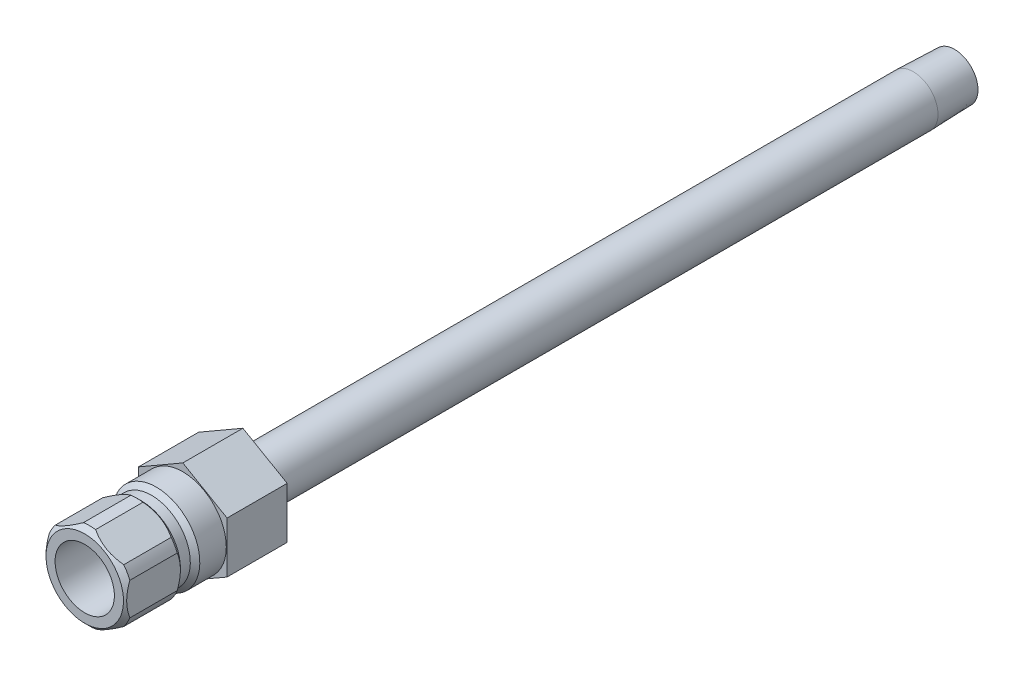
ISO-10303-21;
HEADER;
FILE_DESCRIPTION(('STEP AP214'),'2;1');
FILE_NAME('part.step','',(''),(''),'','','');
FILE_SCHEMA(('AUTOMOTIVE_DESIGN { 1 0 10303 214 1 1 1 1 }'));
ENDSEC;
DATA;
#1=APPLICATION_CONTEXT('core data for automotive mechanical design processes');
#2=APPLICATION_PROTOCOL_DEFINITION('international standard','automotive_design',2000,#1);
#3=PRODUCT_CONTEXT('',#1,'mechanical');
#4=PRODUCT('Part','Part','',(#3));
#5=PRODUCT_RELATED_PRODUCT_CATEGORY('part','',(#4));
#6=PRODUCT_DEFINITION_FORMATION('','',#4);
#7=PRODUCT_DEFINITION_CONTEXT('part definition',#1,'design');
#8=PRODUCT_DEFINITION('design','',#6,#7);
#9=PRODUCT_DEFINITION_SHAPE('','',#8);
#10=(LENGTH_UNIT() NAMED_UNIT(*) SI_UNIT(.MILLI.,.METRE.));
#11=(NAMED_UNIT(*) PLANE_ANGLE_UNIT() SI_UNIT($,.RADIAN.));
#12=(NAMED_UNIT(*) SI_UNIT($,.STERADIAN.) SOLID_ANGLE_UNIT());
#13=UNCERTAINTY_MEASURE_WITH_UNIT(LENGTH_MEASURE(1.E-05),#10,'distance_accuracy_value','');
#14=(GEOMETRIC_REPRESENTATION_CONTEXT(3) GLOBAL_UNCERTAINTY_ASSIGNED_CONTEXT((#13)) GLOBAL_UNIT_ASSIGNED_CONTEXT((#10,
#11,#12)) REPRESENTATION_CONTEXT('',''));
#15=CARTESIAN_POINT('',(0.,0.,0.));
#16=DIRECTION('',(0.,0.,1.));
#17=DIRECTION('',(1.,0.,0.));
#18=AXIS2_PLACEMENT_3D('',#15,#16,#17);
#19=CARTESIAN_POINT('',(0.,0.,-9.652));
#20=DIRECTION('',(0.,0.,-1.));
#21=DIRECTION('',(0.,1.,0.));
#22=AXIS2_PLACEMENT_3D('',#19,#20,#21);
#23=CYLINDRICAL_SURFACE('',#22,6.985);
#24=DIRECTION('',(0.,0.,-1.));
#25=VECTOR('',#24,1.);
#26=CARTESIAN_POINT('',(6.477,2.61509005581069,-9.652));
#27=LINE('',#26,#25);
#28=CARTESIAN_POINT('',(6.477,2.61509005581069,7.366));
#29=VERTEX_POINT('',#28);
#30=CARTESIAN_POINT('',(6.477,2.61509005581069,14.986));
#31=VERTEX_POINT('',#30);
#32=EDGE_CURVE('E381',#29,#31,#27,.F.);
#33=ORIENTED_EDGE('',*,*,#32,.F.);
#34=CARTESIAN_POINT('',(0.,0.,7.366));
#35=DIRECTION('',(0.,0.,-1.));
#36=DIRECTION('',(0.,1.,0.));
#37=AXIS2_PLACEMENT_3D('',#34,#35,#36);
#38=CIRCLE('',#37,6.985);
#39=CARTESIAN_POINT('',(5.50323442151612,4.30170151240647,7.366));
#40=VERTEX_POINT('',#39);
#41=EDGE_CURVE('E190',#40,#29,#38,.T.);
#42=ORIENTED_EDGE('',*,*,#41,.F.);
#43=DIRECTION('',(0.,0.,-1.));
#44=VECTOR('',#43,1.);
#45=CARTESIAN_POINT('',(5.50323442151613,4.30170151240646,-9.652));
#46=LINE('',#45,#44);
#47=CARTESIAN_POINT('',(5.50323442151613,4.30170151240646,14.986));
#48=VERTEX_POINT('',#47);
#49=EDGE_CURVE('E372',#48,#40,#46,.T.);
#50=ORIENTED_EDGE('',*,*,#49,.F.);
#51=CARTESIAN_POINT('',(0.,0.,14.986));
#52=DIRECTION('',(0.,0.,-1.));
#53=DIRECTION('',(0.,1.,0.));
#54=AXIS2_PLACEMENT_3D('',#51,#52,#53);
#55=CIRCLE('',#54,6.985);
#56=EDGE_CURVE('E205',#48,#31,#55,.T.);
#57=ORIENTED_EDGE('',*,*,#56,.T.);
#58=EDGE_LOOP('',(#33,#42,#50,#57));
#59=FACE_BOUND('',#58,.T.);
#60=ADVANCED_FACE('F34',(#59),#23,.T.);
#61=DIRECTION('',(0.,0.,-1.));
#62=VECTOR('',#61,1.);
#63=CARTESIAN_POINT('',(0.973765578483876,6.91679156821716,-9.652));
#64=LINE('',#63,#62);
#65=CARTESIAN_POINT('',(0.973765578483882,6.91679156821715,7.366));
#66=VERTEX_POINT('',#65);
#67=CARTESIAN_POINT('',(0.973765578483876,6.91679156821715,14.986));
#68=VERTEX_POINT('',#67);
#69=EDGE_CURVE('E291',#66,#68,#64,.F.);
#70=ORIENTED_EDGE('',*,*,#69,.F.);
#71=CARTESIAN_POINT('',(-0.973765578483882,6.91679156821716,7.366));
#72=VERTEX_POINT('',#71);
#73=EDGE_CURVE('E194',#72,#66,#38,.T.);
#74=ORIENTED_EDGE('',*,*,#73,.F.);
#75=DIRECTION('',(0.,0.,-1.));
#76=VECTOR('',#75,1.);
#77=CARTESIAN_POINT('',(-0.973765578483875,6.91679156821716,-9.652));
#78=LINE('',#77,#76);
#79=CARTESIAN_POINT('',(-0.973765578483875,6.91679156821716,14.986));
#80=VERTEX_POINT('',#79);
#81=EDGE_CURVE('E54',#80,#72,#78,.T.);
#82=ORIENTED_EDGE('',*,*,#81,.F.);
#83=EDGE_CURVE('E193',#80,#68,#55,.T.);
#84=ORIENTED_EDGE('',*,*,#83,.T.);
#85=EDGE_LOOP('',(#70,#74,#82,#84));
#86=FACE_BOUND('',#85,.T.);
#87=ADVANCED_FACE('F325',(#86),#23,.T.);
#88=DIRECTION('',(0.,0.,-1.));
#89=VECTOR('',#88,1.);
#90=CARTESIAN_POINT('',(-5.50323442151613,4.30170151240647,-9.652));
#91=LINE('',#90,#89);
#92=CARTESIAN_POINT('',(-5.50323442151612,4.30170151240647,7.366));
#93=VERTEX_POINT('',#92);
#94=CARTESIAN_POINT('',(-5.50323442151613,4.30170151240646,14.986));
#95=VERTEX_POINT('',#94);
#96=EDGE_CURVE('E370',#93,#95,#91,.F.);
#97=ORIENTED_EDGE('',*,*,#96,.F.);
#98=CARTESIAN_POINT('',(-6.477,2.6150900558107,7.366));
#99=VERTEX_POINT('',#98);
#100=EDGE_CURVE('E199',#99,#93,#38,.T.);
#101=ORIENTED_EDGE('',*,*,#100,.F.);
#102=DIRECTION('',(0.,0.,-1.));
#103=VECTOR('',#102,1.);
#104=CARTESIAN_POINT('',(-6.477,2.6150900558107,-9.652));
#105=LINE('',#104,#103);
#106=CARTESIAN_POINT('',(-6.477,2.61509005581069,14.986));
#107=VERTEX_POINT('',#106);
#108=EDGE_CURVE('E62',#107,#99,#105,.T.);
#109=ORIENTED_EDGE('',*,*,#108,.F.);
#110=EDGE_CURVE('E204',#107,#95,#55,.T.);
#111=ORIENTED_EDGE('',*,*,#110,.T.);
#112=EDGE_LOOP('',(#97,#101,#109,#111));
#113=FACE_BOUND('',#112,.T.);
#114=ADVANCED_FACE('F330',(#113),#23,.T.);
#115=DIRECTION('',(0.,0.,-1.));
#116=VECTOR('',#115,1.);
#117=CARTESIAN_POINT('',(-6.477,-2.6150900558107,-9.652));
#118=LINE('',#117,#116);
#119=CARTESIAN_POINT('',(-6.477,-2.6150900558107,7.366));
#120=VERTEX_POINT('',#119);
#121=CARTESIAN_POINT('',(-6.477,-2.6150900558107,14.986));
#122=VERTEX_POINT('',#121);
#123=EDGE_CURVE('E362',#120,#122,#118,.F.);
#124=ORIENTED_EDGE('',*,*,#123,.F.);
#125=CARTESIAN_POINT('',(-5.50323442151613,-4.30170151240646,7.366));
#126=VERTEX_POINT('',#125);
#127=EDGE_CURVE('E195',#126,#120,#38,.T.);
#128=ORIENTED_EDGE('',*,*,#127,.F.);
#129=DIRECTION('',(0.,0.,-1.));
#130=VECTOR('',#129,1.);
#131=CARTESIAN_POINT('',(-5.50323442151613,-4.30170151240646,-9.652));
#132=LINE('',#131,#130);
#133=CARTESIAN_POINT('',(-5.50323442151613,-4.30170151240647,14.986));
#134=VERTEX_POINT('',#133);
#135=EDGE_CURVE('E245',#134,#126,#132,.T.);
#136=ORIENTED_EDGE('',*,*,#135,.F.);
#137=EDGE_CURVE('E376',#134,#122,#55,.T.);
#138=ORIENTED_EDGE('',*,*,#137,.T.);
#139=EDGE_LOOP('',(#124,#128,#136,#138));
#140=FACE_BOUND('',#139,.T.);
#141=ADVANCED_FACE('F340',(#140),#23,.T.);
#142=DIRECTION('',(0.,0.,-1.));
#143=VECTOR('',#142,1.);
#144=CARTESIAN_POINT('',(-0.97376557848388,-6.91679156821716,-9.652));
#145=LINE('',#144,#143);
#146=CARTESIAN_POINT('',(-0.973765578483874,-6.91679156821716,7.366));
#147=VERTEX_POINT('',#146);
#148=CARTESIAN_POINT('',(-0.97376557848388,-6.91679156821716,14.986));
#149=VERTEX_POINT('',#148);
#150=EDGE_CURVE('E351',#147,#149,#145,.F.);
#151=ORIENTED_EDGE('',*,*,#150,.F.);
#152=CARTESIAN_POINT('',(0.973765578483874,-6.91679156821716,7.366));
#153=VERTEX_POINT('',#152);
#154=EDGE_CURVE('E191',#153,#147,#38,.T.);
#155=ORIENTED_EDGE('',*,*,#154,.F.);
#156=DIRECTION('',(0.,0.,-1.));
#157=VECTOR('',#156,1.);
#158=CARTESIAN_POINT('',(0.973765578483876,-6.91679156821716,-9.652));
#159=LINE('',#158,#157);
#160=CARTESIAN_POINT('',(0.973765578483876,-6.91679156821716,14.986));
#161=VERTEX_POINT('',#160);
#162=EDGE_CURVE('E168',#161,#153,#159,.T.);
#163=ORIENTED_EDGE('',*,*,#162,.F.);
#164=EDGE_CURVE('E353',#161,#149,#55,.T.);
#165=ORIENTED_EDGE('',*,*,#164,.T.);
#166=EDGE_LOOP('',(#151,#155,#163,#165));
#167=FACE_BOUND('',#166,.T.);
#168=ADVANCED_FACE('F334',(#167),#23,.T.);
#169=CARTESIAN_POINT('',(0.,0.,-9.652));
#170=DIRECTION('',(0.,0.,-1.));
#171=DIRECTION('',(0.,1.,0.));
#172=AXIS2_PLACEMENT_3D('',#169,#170,#171);
#173=CYLINDRICAL_SURFACE('',#172,2.65430000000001);
#174=CARTESIAN_POINT('',(0.,0.,2.43505017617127));
#175=DIRECTION('',(0.,0.,-1.));
#176=DIRECTION('',(0.,1.,0.));
#177=AXIS2_PLACEMENT_3D('',#174,#175,#176);
#178=CIRCLE('',#177,2.6543);
#179=CARTESIAN_POINT('',(0.,2.6543,2.43505017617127));
#180=VERTEX_POINT('',#179);
#181=EDGE_CURVE('E215',#180,#180,#178,.T.);
#182=ORIENTED_EDGE('',*,*,#181,.F.);
#183=EDGE_LOOP('',(#182));
#184=FACE_BOUND('',#183,.T.);
#185=CARTESIAN_POINT('',(0.,0.,-123.952));
#186=DIRECTION('',(0.,0.,-1.));
#187=DIRECTION('',(0.,1.,0.));
#188=AXIS2_PLACEMENT_3D('',#185,#186,#187);
#189=CIRCLE('',#188,2.65430000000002);
#190=CARTESIAN_POINT('',(0.,2.65430000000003,-123.952));
#191=VERTEX_POINT('',#190);
#192=EDGE_CURVE('E429',#191,#191,#189,.T.);
#193=ORIENTED_EDGE('',*,*,#192,.T.);
#194=EDGE_LOOP('',(#193));
#195=FACE_BOUND('',#194,.T.);
#196=ADVANCED_FACE('F36',(#184,#195),#173,.F.);
#197=CARTESIAN_POINT('',(0.,0.,3.556));
#198=DIRECTION('',(0.,0.,1.));
#199=DIRECTION('',(0.,-1.,0.));
#200=AXIS2_PLACEMENT_3D('',#197,#198,#199);
#201=CONICAL_SURFACE('',#200,4.7625,1.08210413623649);
#202=ORIENTED_EDGE('',*,*,#181,.T.);
#203=EDGE_LOOP('',(#202));
#204=FACE_BOUND('',#203,.T.);
#205=CARTESIAN_POINT('',(0.,0.,3.556));
#206=DIRECTION('',(0.,0.,-1.));
#207=DIRECTION('',(0.,1.,0.));
#208=AXIS2_PLACEMENT_3D('',#205,#206,#207);
#209=CIRCLE('',#208,4.7625);
#210=CARTESIAN_POINT('',(0.,4.7625,3.556));
#211=VERTEX_POINT('',#210);
#212=EDGE_CURVE('E212',#211,#211,#209,.T.);
#213=ORIENTED_EDGE('',*,*,#212,.F.);
#214=EDGE_LOOP('',(#213));
#215=FACE_BOUND('',#214,.T.);
#216=ADVANCED_FACE('F346',(#204,#215),#201,.F.);
#217=CARTESIAN_POINT('',(0.,0.,-9.652));
#218=DIRECTION('',(0.,0.,-1.));
#219=DIRECTION('',(0.,1.,0.));
#220=AXIS2_PLACEMENT_3D('',#217,#218,#219);
#221=CYLINDRICAL_SURFACE('',#220,4.7625);
#222=ORIENTED_EDGE('',*,*,#212,.T.);
#223=EDGE_LOOP('',(#222));
#224=FACE_BOUND('',#223,.T.);
#225=CARTESIAN_POINT('',(0.,0.,15.748));
#226=DIRECTION('',(0.,0.,-1.));
#227=DIRECTION('',(0.,1.,0.));
#228=AXIS2_PLACEMENT_3D('',#225,#226,#227);
#229=CIRCLE('',#228,4.7625);
#230=CARTESIAN_POINT('',(0.,4.7625,15.748));
#231=VERTEX_POINT('',#230);
#232=EDGE_CURVE('E209',#231,#231,#229,.T.);
#233=ORIENTED_EDGE('',*,*,#232,.F.);
#234=EDGE_LOOP('',(#233));
#235=FACE_BOUND('',#234,.T.);
#236=ADVANCED_FACE('F671',(#224,#235),#221,.F.);
#237=CARTESIAN_POINT('',(0.,4.7625,15.748));
#238=DIRECTION('',(0.,0.,1.));
#239=DIRECTION('',(0.,-1.,0.));
#240=AXIS2_PLACEMENT_3D('',#237,#238,#239);
#241=PLANE('',#240);
#242=ORIENTED_EDGE('',*,*,#232,.T.);
#243=EDGE_LOOP('',(#242));
#244=FACE_BOUND('',#243,.T.);
#245=CARTESIAN_POINT('',(0.,0.,15.748));
#246=DIRECTION('',(0.,0.,-1.));
#247=DIRECTION('',(0.,1.,0.));
#248=AXIS2_PLACEMENT_3D('',#245,#246,#247);
#249=CIRCLE('',#248,6.223);
#250=CARTESIAN_POINT('',(0.,6.223,15.748));
#251=VERTEX_POINT('',#250);
#252=EDGE_CURVE('E206',#251,#251,#249,.T.);
#253=ORIENTED_EDGE('',*,*,#252,.F.);
#254=EDGE_LOOP('',(#253));
#255=FACE_BOUND('',#254,.T.);
#256=ADVANCED_FACE('F252',(#244,#255),#241,.T.);
#257=CARTESIAN_POINT('',(0.,0.,14.986));
#258=DIRECTION('',(0.,0.,-1.));
#259=DIRECTION('',(0.,1.,0.));
#260=AXIS2_PLACEMENT_3D('',#257,#258,#259);
#261=CONICAL_SURFACE('',#260,6.985,0.785398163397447);
#262=CARTESIAN_POINT('',(6.477,-7.50531717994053,12.0573066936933));
#263=CARTESIAN_POINT('',(6.477,-7.32278230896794,12.1954662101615));
#264=CARTESIAN_POINT('',(6.477,-7.13923073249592,12.3323042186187));
#265=CARTESIAN_POINT('',(6.477,-6.76969107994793,12.6027438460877));
#266=CARTESIAN_POINT('',(6.477,-6.58370240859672,12.7363446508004));
#267=CARTESIAN_POINT('',(6.477,-6.20752484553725,13.0006667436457));
#268=CARTESIAN_POINT('',(6.477,-6.01731457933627,13.1313577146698));
#269=CARTESIAN_POINT('',(6.477,-5.63367369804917,13.3879087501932));
#270=CARTESIAN_POINT('',(6.477,-5.44024331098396,13.5137691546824));
#271=CARTESIAN_POINT('',(6.477,-5.03831720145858,13.7667102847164));
#272=CARTESIAN_POINT('',(6.477,-4.8295984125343,13.8934383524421));
#273=CARTESIAN_POINT('',(6.477,-4.40728395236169,14.1386241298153));
#274=CARTESIAN_POINT('',(6.477,-4.19368750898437,14.2570805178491));
#275=CARTESIAN_POINT('',(6.477,-3.7616267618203,14.4831715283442));
#276=CARTESIAN_POINT('',(6.477,-3.54317924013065,14.5908379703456));
#277=CARTESIAN_POINT('',(6.477,-3.100295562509,14.7929384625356));
#278=CARTESIAN_POINT('',(6.477,-2.87586219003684,14.8873785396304));
#279=CARTESIAN_POINT('',(6.477,-2.43955826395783,15.0524966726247));
#280=CARTESIAN_POINT('',(6.477,-2.22819339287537,15.1244971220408));
#281=CARTESIAN_POINT('',(6.477,-1.80033354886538,15.2515475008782));
#282=CARTESIAN_POINT('',(6.477,-1.58383822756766,15.3065962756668));
#283=CARTESIAN_POINT('',(6.477,-1.1506339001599,15.3959385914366));
#284=CARTESIAN_POINT('',(6.477,-0.934000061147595,15.4305906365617));
#285=CARTESIAN_POINT('',(6.477,-0.498364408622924,15.4784594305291));
#286=CARTESIAN_POINT('',(6.477,-0.279363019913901,15.4916799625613));
#287=CARTESIAN_POINT('',(6.477,0.150697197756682,15.4956835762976));
#288=CARTESIAN_POINT('',(6.477,0.361748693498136,15.4872823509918));
#289=CARTESIAN_POINT('',(6.477,0.782066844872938,15.4503172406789));
#290=CARTESIAN_POINT('',(6.477,0.991333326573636,15.421751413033));
#291=CARTESIAN_POINT('',(6.477,1.41010575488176,15.3455375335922));
#292=CARTESIAN_POINT('',(6.477,1.6195513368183,15.2975631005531));
#293=CARTESIAN_POINT('',(6.477,2.03387291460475,15.1851046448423));
#294=CARTESIAN_POINT('',(6.477,2.2387492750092,15.1206219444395));
#295=CARTESIAN_POINT('',(6.477,2.66141718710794,14.9715598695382));
#296=CARTESIAN_POINT('',(6.477,2.87875617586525,14.8857103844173));
#297=CARTESIAN_POINT('',(6.477,3.30779766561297,14.7008180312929));
#298=CARTESIAN_POINT('',(6.477,3.51949749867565,14.6017690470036));
#299=CARTESIAN_POINT('',(6.477,3.9382898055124,14.3928329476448));
#300=CARTESIAN_POINT('',(6.477,4.14536521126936,14.282911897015));
#301=CARTESIAN_POINT('',(6.477,4.55475391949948,14.0546596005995));
#302=CARTESIAN_POINT('',(6.477,4.75706796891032,13.93632968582));
#303=CARTESIAN_POINT('',(6.477,5.14761370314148,13.6989609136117));
#304=CARTESIAN_POINT('',(6.477,5.33604552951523,13.580249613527));
#305=CARTESIAN_POINT('',(6.477,5.70967381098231,13.3378251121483));
#306=CARTESIAN_POINT('',(6.477,5.89487001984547,13.2141115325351));
#307=CARTESIAN_POINT('',(6.477,6.26095063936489,12.9635958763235));
#308=CARTESIAN_POINT('',(6.477,6.44185783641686,12.8368269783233));
#309=CARTESIAN_POINT('',(6.477,6.80119835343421,12.5799293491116));
#310=CARTESIAN_POINT('',(6.477,6.97963234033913,12.4498015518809));
#311=CARTESIAN_POINT('',(6.477,7.15703038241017,12.3183002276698));
#312=B_SPLINE_CURVE_WITH_KNOTS('',3,(#262,#263,#264,#265,#266,#267,#268,#269,#270,#271,#272,
#273,#274,#275,#276,#277,#278,#279,#280,#281,#282,#283,#284,#285,#286,#287,#288,#289,#290,#291,
#292,#293,#294,#295,#296,#297,#298,#299,#300,#301,#302,#303,#304,#305,#306,#307,#308,#309,#310,
#311),.UNSPECIFIED.,.F.,.F.,(4,2,2,2,2,2,2,2,2,2,2,2,2,2,2,2,2,2,2,2,2,2,2,2,4),(0.,
0.686790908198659,1.37375281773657,2.06603541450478,2.75826919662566,3.49065471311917,
4.22315698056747,4.95343127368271,5.68337170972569,6.35265989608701,7.02199365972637,
7.67918147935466,8.33625327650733,8.96890298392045,9.6016136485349,10.2454384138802,
10.8892116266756,11.5897073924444,12.2905288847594,12.9936114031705,13.6965828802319,
14.3646145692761,15.0326968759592,15.6953618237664,16.3578444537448),.UNSPECIFIED.);
#313=CARTESIAN_POINT('',(6.477,-2.61509005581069,14.986));
#314=VERTEX_POINT('',#313);
#315=EDGE_CURVE('E384',#31,#314,#312,.F.);
#316=ORIENTED_EDGE('',*,*,#315,.F.);
#317=ORIENTED_EDGE('',*,*,#56,.F.);
#318=CARTESIAN_POINT('',(0.973302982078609,6.91705864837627,14.9858));
#319=CARTESIAN_POINT('',(1.15430521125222,6.81255696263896,15.0641166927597));
#320=CARTESIAN_POINT('',(1.33782092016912,6.70660411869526,15.1353544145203));
#321=CARTESIAN_POINT('',(1.70963160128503,6.49193912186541,15.2608524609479));
#322=CARTESIAN_POINT('',(1.89793754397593,6.38322063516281,15.3150691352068));
#323=CARTESIAN_POINT('',(2.27146153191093,6.16756646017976,15.401724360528));
#324=CARTESIAN_POINT('',(2.45655498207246,6.06070270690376,15.4348622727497));
#325=CARTESIAN_POINT('',(2.82844640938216,5.8459910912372,15.4802195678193));
#326=CARTESIAN_POINT('',(3.01524193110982,5.73814464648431,15.4924653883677));
#327=CARTESIAN_POINT('',(3.39480578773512,5.51900335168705,15.4953056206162));
#328=CARTESIAN_POINT('',(3.58757842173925,5.40770601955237,15.4852117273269));
#329=CARTESIAN_POINT('',(3.97148128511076,5.18605959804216,15.4426708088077));
#330=CARTESIAN_POINT('',(4.16260891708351,5.07571200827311,15.4101933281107));
#331=CARTESIAN_POINT('',(4.54854122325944,4.85289388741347,15.3234273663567));
#332=CARTESIAN_POINT('',(4.74321398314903,4.74049951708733,15.268364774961));
#333=CARTESIAN_POINT('',(5.03141021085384,4.57410934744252,15.1720079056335));
#334=CARTESIAN_POINT('',(5.12673323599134,4.51907457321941,15.1376422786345));
#335=CARTESIAN_POINT('',(5.31613879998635,4.40972121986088,15.0647445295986));
#336=CARTESIAN_POINT('',(5.41022179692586,4.35540237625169,15.0262139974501));
#337=CARTESIAN_POINT('',(5.5036970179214,4.30143443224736,14.9858));
#338=B_SPLINE_CURVE_WITH_KNOTS('',3,(#318,#319,#320,#321,#322,#323,#324,#325,#326,#327,#328,
#329,#330,#331,#332,#333,#334,#335,#336,#337),.UNSPECIFIED.,.F.,.F.,(4,2,2,2,2,2,2,2,2,4),(0.,
0.669810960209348,1.34132587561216,1.9892054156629,2.63626449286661,3.30353665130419,
3.97171850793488,4.6650216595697,5.01088265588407,5.3566120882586),.UNSPECIFIED.);
#339=EDGE_CURVE('E283',#68,#48,#338,.T.);
#340=ORIENTED_EDGE('',*,*,#339,.F.);
#341=ORIENTED_EDGE('',*,*,#83,.F.);
#342=CARTESIAN_POINT('',(-5.50369701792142,4.30143443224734,14.9858));
#343=CARTESIAN_POINT('',(-5.32269478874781,4.40593611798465,15.0641166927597));
#344=CARTESIAN_POINT('',(-5.1391790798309,4.51188896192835,15.1353544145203));
#345=CARTESIAN_POINT('',(-4.76736839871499,4.7265539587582,15.2608524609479));
#346=CARTESIAN_POINT('',(-4.57906245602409,4.8352724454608,15.3150691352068));
#347=CARTESIAN_POINT('',(-4.20553846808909,5.05092662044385,15.401724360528));
#348=CARTESIAN_POINT('',(-4.02044501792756,5.15779037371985,15.4348622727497));
#349=CARTESIAN_POINT('',(-3.64855359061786,5.37250198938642,15.4802195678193));
#350=CARTESIAN_POINT('',(-3.4617580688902,5.4803484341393,15.4924653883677));
#351=CARTESIAN_POINT('',(-3.0821942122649,5.69948972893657,15.4953056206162));
#352=CARTESIAN_POINT('',(-2.88942157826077,5.81078706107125,15.4852117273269));
#353=CARTESIAN_POINT('',(-2.50551871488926,6.03243348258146,15.4426708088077));
#354=CARTESIAN_POINT('',(-2.3143910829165,6.1427810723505,15.4101933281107));
#355=CARTESIAN_POINT('',(-1.92845877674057,6.36559919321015,15.3234273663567));
#356=CARTESIAN_POINT('',(-1.73378601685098,6.47799356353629,15.268364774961));
#357=CARTESIAN_POINT('',(-1.44558978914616,6.6443837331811,15.1720079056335));
#358=CARTESIAN_POINT('',(-1.35026676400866,6.69941850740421,15.1376422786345));
#359=CARTESIAN_POINT('',(-1.16086120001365,6.80877186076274,15.0647445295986));
#360=CARTESIAN_POINT('',(-1.06677820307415,6.86309070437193,15.0262139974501));
#361=CARTESIAN_POINT('',(-0.973302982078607,6.91705864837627,14.9858));
#362=B_SPLINE_CURVE_WITH_KNOTS('',3,(#342,#343,#344,#345,#346,#347,#348,#349,#350,#351,#352,
#353,#354,#355,#356,#357,#358,#359,#360,#361),.UNSPECIFIED.,.F.,.F.,(4,2,2,2,2,2,2,2,2,4),(0.,
0.669810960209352,1.34132587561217,1.98920541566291,2.63626449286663,3.30353665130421,
3.9717185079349,4.66502165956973,5.0108826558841,5.35661208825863),.UNSPECIFIED.);
#363=EDGE_CURVE('E275',#95,#80,#362,.T.);
#364=ORIENTED_EDGE('',*,*,#363,.F.);
#365=ORIENTED_EDGE('',*,*,#110,.F.);
#366=CARTESIAN_POINT('',(-6.477,-7.50531717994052,12.0573066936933));
#367=CARTESIAN_POINT('',(-6.477,-7.32278230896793,12.1954662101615));
#368=CARTESIAN_POINT('',(-6.477,-7.13923073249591,12.3323042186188));
#369=CARTESIAN_POINT('',(-6.477,-6.76969107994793,12.6027438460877));
#370=CARTESIAN_POINT('',(-6.477,-6.58370240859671,12.7363446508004));
#371=CARTESIAN_POINT('',(-6.477,-6.20752484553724,13.0006667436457));
#372=CARTESIAN_POINT('',(-6.477,-6.01731457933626,13.1313577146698));
#373=CARTESIAN_POINT('',(-6.477,-5.63367369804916,13.3879087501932));
#374=CARTESIAN_POINT('',(-6.477,-5.44024331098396,13.5137691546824));
#375=CARTESIAN_POINT('',(-6.477,-5.03831720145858,13.7667102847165));
#376=CARTESIAN_POINT('',(-6.477,-4.82959841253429,13.8934383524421));
#377=CARTESIAN_POINT('',(-6.477,-4.40728395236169,14.1386241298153));
#378=CARTESIAN_POINT('',(-6.477,-4.19368750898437,14.2570805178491));
#379=CARTESIAN_POINT('',(-6.477,-3.7616267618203,14.4831715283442));
#380=CARTESIAN_POINT('',(-6.477,-3.54317924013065,14.5908379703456));
#381=CARTESIAN_POINT('',(-6.477,-3.100295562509,14.7929384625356));
#382=CARTESIAN_POINT('',(-6.477,-2.87586219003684,14.8873785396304));
#383=CARTESIAN_POINT('',(-6.477,-2.43955826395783,15.0524966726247));
#384=CARTESIAN_POINT('',(-6.477,-2.22819339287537,15.1244971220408));
#385=CARTESIAN_POINT('',(-6.477,-1.80033354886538,15.2515475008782));
#386=CARTESIAN_POINT('',(-6.477,-1.58383822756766,15.3065962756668));
#387=CARTESIAN_POINT('',(-6.477,-1.15063390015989,15.3959385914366));
#388=CARTESIAN_POINT('',(-6.477,-0.934000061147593,15.4305906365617));
#389=CARTESIAN_POINT('',(-6.477,-0.498364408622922,15.4784594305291));
#390=CARTESIAN_POINT('',(-6.477,-0.279363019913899,15.4916799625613));
#391=CARTESIAN_POINT('',(-6.477,0.150697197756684,15.4956835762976));
#392=CARTESIAN_POINT('',(-6.477,0.361748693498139,15.4872823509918));
#393=CARTESIAN_POINT('',(-6.477,0.78206684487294,15.4503172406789));
#394=CARTESIAN_POINT('',(-6.477,0.991333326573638,15.421751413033));
#395=CARTESIAN_POINT('',(-6.477,1.41010575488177,15.3455375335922));
#396=CARTESIAN_POINT('',(-6.477,1.6195513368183,15.2975631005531));
#397=CARTESIAN_POINT('',(-6.477,2.03387291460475,15.1851046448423));
#398=CARTESIAN_POINT('',(-6.477,2.2387492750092,15.1206219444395));
#399=CARTESIAN_POINT('',(-6.477,2.66141718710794,14.9715598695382));
#400=CARTESIAN_POINT('',(-6.477,2.87875617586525,14.8857103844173));
#401=CARTESIAN_POINT('',(-6.477,3.30779766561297,14.7008180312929));
#402=CARTESIAN_POINT('',(-6.477,3.51949749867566,14.6017690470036));
#403=CARTESIAN_POINT('',(-6.477,3.9382898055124,14.3928329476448));
#404=CARTESIAN_POINT('',(-6.477,4.14536521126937,14.282911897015));
#405=CARTESIAN_POINT('',(-6.477,4.55475391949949,14.0546596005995));
#406=CARTESIAN_POINT('',(-6.477,4.75706796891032,13.93632968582));
#407=CARTESIAN_POINT('',(-6.477,5.14761370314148,13.6989609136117));
#408=CARTESIAN_POINT('',(-6.477,5.33604552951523,13.580249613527));
#409=CARTESIAN_POINT('',(-6.477,5.70967381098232,13.3378251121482));
#410=CARTESIAN_POINT('',(-6.477,5.89487001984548,13.2141115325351));
#411=CARTESIAN_POINT('',(-6.477,6.26095063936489,12.9635958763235));
#412=CARTESIAN_POINT('',(-6.477,6.44185783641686,12.8368269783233));
#413=CARTESIAN_POINT('',(-6.477,6.80119835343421,12.5799293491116));
#414=CARTESIAN_POINT('',(-6.477,6.97963234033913,12.4498015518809));
#415=CARTESIAN_POINT('',(-6.477,7.15703038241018,12.3183002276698));
#416=B_SPLINE_CURVE_WITH_KNOTS('',3,(#366,#367,#368,#369,#370,#371,#372,#373,#374,#375,#376,
#377,#378,#379,#380,#381,#382,#383,#384,#385,#386,#387,#388,#389,#390,#391,#392,#393,#394,#395,
#396,#397,#398,#399,#400,#401,#402,#403,#404,#405,#406,#407,#408,#409,#410,#411,#412,#413,#414,
#415),.UNSPECIFIED.,.F.,.F.,(4,2,2,2,2,2,2,2,2,2,2,2,2,2,2,2,2,2,2,2,2,2,2,2,4),(0.,
0.686790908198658,1.37375281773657,2.06603541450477,2.75826919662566,3.49065471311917,
4.22315698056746,4.95343127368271,5.68337170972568,6.352659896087,7.02199365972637,
7.67918147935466,8.33625327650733,8.96890298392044,9.6016136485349,10.2454384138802,
10.8892116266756,11.5897073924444,12.2905288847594,12.9936114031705,13.6965828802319,
14.3646145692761,15.0326968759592,15.6953618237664,16.3578444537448),.UNSPECIFIED.);
#417=EDGE_CURVE('E268',#122,#107,#416,.T.);
#418=ORIENTED_EDGE('',*,*,#417,.F.);
#419=ORIENTED_EDGE('',*,*,#137,.F.);
#420=CARTESIAN_POINT('',(-0.973302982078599,-6.91705864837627,14.9858));
#421=CARTESIAN_POINT('',(-1.15430521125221,-6.81255696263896,15.0641166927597));
#422=CARTESIAN_POINT('',(-1.33782092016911,-6.70660411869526,15.1353544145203));
#423=CARTESIAN_POINT('',(-1.70963160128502,-6.49193912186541,15.2608524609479));
#424=CARTESIAN_POINT('',(-1.89793754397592,-6.38322063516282,15.3150691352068));
#425=CARTESIAN_POINT('',(-2.27146153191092,-6.16756646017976,15.401724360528));
#426=CARTESIAN_POINT('',(-2.45655498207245,-6.06070270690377,15.4348622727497));
#427=CARTESIAN_POINT('',(-2.82844640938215,-5.8459910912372,15.4802195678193));
#428=CARTESIAN_POINT('',(-3.01524193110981,-5.73814464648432,15.4924653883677));
#429=CARTESIAN_POINT('',(-3.39480578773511,-5.51900335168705,15.4953056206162));
#430=CARTESIAN_POINT('',(-3.58757842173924,-5.40770601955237,15.4852117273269));
#431=CARTESIAN_POINT('',(-3.97148128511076,-5.18605959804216,15.4426708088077));
#432=CARTESIAN_POINT('',(-4.16260891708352,-5.07571200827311,15.4101933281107));
#433=CARTESIAN_POINT('',(-4.54854122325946,-4.85289388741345,15.3234273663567));
#434=CARTESIAN_POINT('',(-4.74321398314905,-4.74049951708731,15.268364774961));
#435=CARTESIAN_POINT('',(-5.03141021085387,-4.5741093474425,15.1720079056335));
#436=CARTESIAN_POINT('',(-5.12673323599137,-4.51907457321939,15.1376422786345));
#437=CARTESIAN_POINT('',(-5.31613879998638,-4.40972121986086,15.0647445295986));
#438=CARTESIAN_POINT('',(-5.41022179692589,-4.35540237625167,15.0262139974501));
#439=CARTESIAN_POINT('',(-5.50369701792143,-4.30143443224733,14.9858));
#440=B_SPLINE_CURVE_WITH_KNOTS('',3,(#420,#421,#422,#423,#424,#425,#426,#427,#428,#429,#430,
#431,#432,#433,#434,#435,#436,#437,#438,#439),.UNSPECIFIED.,.F.,.F.,(4,2,2,2,2,2,2,2,2,4),(0.,
0.669810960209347,1.34132587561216,1.9892054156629,2.63626449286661,3.3035366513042,
3.97171850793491,4.66502165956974,5.01088265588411,5.35661208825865),.UNSPECIFIED.);
#441=EDGE_CURVE('E261',#149,#134,#440,.T.);
#442=ORIENTED_EDGE('',*,*,#441,.F.);
#443=ORIENTED_EDGE('',*,*,#164,.F.);
#444=CARTESIAN_POINT('',(5.5036970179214,-4.30143443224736,14.9858));
#445=CARTESIAN_POINT('',(5.32269478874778,-4.40593611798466,15.0641166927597));
#446=CARTESIAN_POINT('',(5.13917907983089,-4.51188896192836,15.1353544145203));
#447=CARTESIAN_POINT('',(4.76736839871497,-4.72655395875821,15.2608524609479));
#448=CARTESIAN_POINT('',(4.57906245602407,-4.83527244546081,15.3150691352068));
#449=CARTESIAN_POINT('',(4.20553846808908,-5.05092662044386,15.401724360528));
#450=CARTESIAN_POINT('',(4.02044501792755,-5.15779037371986,15.4348622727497));
#451=CARTESIAN_POINT('',(3.64855359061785,-5.37250198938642,15.4802195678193));
#452=CARTESIAN_POINT('',(3.46175806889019,-5.4803484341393,15.4924653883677));
#453=CARTESIAN_POINT('',(3.08219421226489,-5.69948972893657,15.4953056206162));
#454=CARTESIAN_POINT('',(2.88942157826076,-5.81078706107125,15.4852117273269));
#455=CARTESIAN_POINT('',(2.50551871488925,-6.03243348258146,15.4426708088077));
#456=CARTESIAN_POINT('',(2.31439108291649,-6.14278107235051,15.4101933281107));
#457=CARTESIAN_POINT('',(1.92845877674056,-6.36559919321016,15.3234273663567));
#458=CARTESIAN_POINT('',(1.73378601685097,-6.4779935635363,15.268364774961));
#459=CARTESIAN_POINT('',(1.44558978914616,-6.64438373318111,15.1720079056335));
#460=CARTESIAN_POINT('',(1.35026676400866,-6.69941850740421,15.1376422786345));
#461=CARTESIAN_POINT('',(1.16086120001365,-6.80877186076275,15.0647445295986));
#462=CARTESIAN_POINT('',(1.06677820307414,-6.86309070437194,15.0262139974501));
#463=CARTESIAN_POINT('',(0.973302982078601,-6.91705864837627,14.9858));
#464=B_SPLINE_CURVE_WITH_KNOTS('',3,(#444,#445,#446,#447,#448,#449,#450,#451,#452,#453,#454,
#455,#456,#457,#458,#459,#460,#461,#462,#463),.UNSPECIFIED.,.F.,.F.,(4,2,2,2,2,2,2,2,2,4),(0.,
0.669810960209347,1.34132587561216,1.9892054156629,2.63626449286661,3.30353665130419,
3.97171850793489,4.66502165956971,5.01088265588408,5.35661208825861),.UNSPECIFIED.);
#465=CARTESIAN_POINT('',(5.50323442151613,-4.30170151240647,14.986));
#466=VERTEX_POINT('',#465);
#467=EDGE_CURVE('E184',#466,#161,#464,.T.);
#468=ORIENTED_EDGE('',*,*,#467,.F.);
#469=EDGE_CURVE('E183',#314,#466,#55,.T.);
#470=ORIENTED_EDGE('',*,*,#469,.F.);
#471=EDGE_LOOP('',(#316,#317,#340,#341,#364,#365,#418,#419,#442,#443,#468,#470));
#472=FACE_BOUND('',#471,.T.);
#473=ORIENTED_EDGE('',*,*,#252,.T.);
#474=EDGE_LOOP('',(#473));
#475=FACE_BOUND('',#474,.T.);
#476=ADVANCED_FACE('F248',(#472,#475),#261,.T.);
#477=DIRECTION('',(0.,0.,-1.));
#478=VECTOR('',#477,1.);
#479=CARTESIAN_POINT('',(6.477,-2.61509005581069,-9.652));
#480=LINE('',#479,#478);
#481=CARTESIAN_POINT('',(6.477,-2.61509005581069,7.366));
#482=VERTEX_POINT('',#481);
#483=EDGE_CURVE('E290',#314,#482,#480,.T.);
#484=ORIENTED_EDGE('',*,*,#483,.F.);
#485=ORIENTED_EDGE('',*,*,#469,.T.);
#486=DIRECTION('',(0.,0.,-1.));
#487=VECTOR('',#486,1.);
#488=CARTESIAN_POINT('',(5.50323442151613,-4.30170151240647,-9.652));
#489=LINE('',#488,#487);
#490=CARTESIAN_POINT('',(5.50323442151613,-4.30170151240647,7.366));
#491=VERTEX_POINT('',#490);
#492=EDGE_CURVE('E165',#491,#466,#489,.F.);
#493=ORIENTED_EDGE('',*,*,#492,.F.);
#494=EDGE_CURVE('E181',#482,#491,#38,.T.);
#495=ORIENTED_EDGE('',*,*,#494,.F.);
#496=EDGE_LOOP('',(#484,#485,#493,#495));
#497=FACE_BOUND('',#496,.T.);
#498=ADVANCED_FACE('F180',(#497),#23,.T.);
#499=CARTESIAN_POINT('',(0.,0.,6.604));
#500=DIRECTION('',(0.,0.,1.));
#501=DIRECTION('',(0.,-1.,0.));
#502=AXIS2_PLACEMENT_3D('',#499,#500,#501);
#503=CONICAL_SURFACE('',#502,6.223,0.785398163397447);
#504=CARTESIAN_POINT('',(6.477,-7.50531717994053,10.2946933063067));
#505=CARTESIAN_POINT('',(6.477,-7.32278230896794,10.1565337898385));
#506=CARTESIAN_POINT('',(6.477,-7.13923073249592,10.0196957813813));
#507=CARTESIAN_POINT('',(6.477,-6.76969107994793,9.74925615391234));
#508=CARTESIAN_POINT('',(6.477,-6.58370240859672,9.61565534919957));
#509=CARTESIAN_POINT('',(6.477,-6.20752484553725,9.35133325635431));
#510=CARTESIAN_POINT('',(6.477,-6.01731457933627,9.22064228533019));
#511=CARTESIAN_POINT('',(6.477,-5.63367369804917,8.96409124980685));
#512=CARTESIAN_POINT('',(6.477,-5.44024331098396,8.83823084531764));
#513=CARTESIAN_POINT('',(6.477,-5.03831720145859,8.58528971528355));
#514=CARTESIAN_POINT('',(6.477,-4.8295984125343,8.45856164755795));
#515=CARTESIAN_POINT('',(6.477,-4.4072839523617,8.21337587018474));
#516=CARTESIAN_POINT('',(6.477,-4.19368750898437,8.09491948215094));
#517=CARTESIAN_POINT('',(6.477,-3.7616267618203,7.8688284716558));
#518=CARTESIAN_POINT('',(6.477,-3.54317924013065,7.76116202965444));
#519=CARTESIAN_POINT('',(6.477,-3.100295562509,7.55906153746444));
#520=CARTESIAN_POINT('',(6.477,-2.87586219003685,7.46462146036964));
#521=CARTESIAN_POINT('',(6.477,-2.43955826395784,7.2995033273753));
#522=CARTESIAN_POINT('',(6.477,-2.22819339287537,7.2275028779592));
#523=CARTESIAN_POINT('',(6.477,-1.80033354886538,7.1004524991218));
#524=CARTESIAN_POINT('',(6.477,-1.58383822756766,7.0454037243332));
#525=CARTESIAN_POINT('',(6.477,-1.1506339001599,6.95606140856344));
#526=CARTESIAN_POINT('',(6.477,-0.934000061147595,6.9214093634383));
#527=CARTESIAN_POINT('',(6.477,-0.498364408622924,6.87354056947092));
#528=CARTESIAN_POINT('',(6.477,-0.279363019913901,6.86032003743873));
#529=CARTESIAN_POINT('',(6.477,0.150697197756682,6.85631642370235));
#530=CARTESIAN_POINT('',(6.477,0.361748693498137,6.86471764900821));
#531=CARTESIAN_POINT('',(6.477,0.78206684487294,6.90168275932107));
#532=CARTESIAN_POINT('',(6.477,0.991333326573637,6.93024858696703));
#533=CARTESIAN_POINT('',(6.477,1.41010575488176,7.00646246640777));
#534=CARTESIAN_POINT('',(6.477,1.6195513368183,7.05443689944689));
#535=CARTESIAN_POINT('',(6.477,2.03387291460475,7.16689535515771));
#536=CARTESIAN_POINT('',(6.477,2.2387492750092,7.2313780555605));
#537=CARTESIAN_POINT('',(6.477,2.66141718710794,7.38044013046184));
#538=CARTESIAN_POINT('',(6.477,2.87875617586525,7.46628961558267));
#539=CARTESIAN_POINT('',(6.477,3.30779766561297,7.65118196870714));
#540=CARTESIAN_POINT('',(6.477,3.51949749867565,7.75023095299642));
#541=CARTESIAN_POINT('',(6.477,3.9382898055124,7.95916705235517));
#542=CARTESIAN_POINT('',(6.477,4.14536521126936,8.06908810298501));
#543=CARTESIAN_POINT('',(6.477,4.55475391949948,8.29734039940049));
#544=CARTESIAN_POINT('',(6.477,4.75706796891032,8.41567031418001));
#545=CARTESIAN_POINT('',(6.477,5.14761370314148,8.65303908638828));
#546=CARTESIAN_POINT('',(6.477,5.33604552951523,8.77175038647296));
#547=CARTESIAN_POINT('',(6.477,5.70967381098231,9.01417488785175));
#548=CARTESIAN_POINT('',(6.477,5.89487001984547,9.13788846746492));
#549=CARTESIAN_POINT('',(6.477,6.26095063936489,9.38840412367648));
#550=CARTESIAN_POINT('',(6.477,6.44185783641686,9.51517302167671));
#551=CARTESIAN_POINT('',(6.477,6.80119835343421,9.77207065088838));
#552=CARTESIAN_POINT('',(6.477,6.97963234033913,9.90219844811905));
#553=CARTESIAN_POINT('',(6.477,7.15703038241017,10.0336997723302));
#554=B_SPLINE_CURVE_WITH_KNOTS('',3,(#504,#505,#506,#507,#508,#509,#510,#511,#512,#513,#514,
#515,#516,#517,#518,#519,#520,#521,#522,#523,#524,#525,#526,#527,#528,#529,#530,#531,#532,#533,
#534,#535,#536,#537,#538,#539,#540,#541,#542,#543,#544,#545,#546,#547,#548,#549,#550,#551,#552,
#553),.UNSPECIFIED.,.F.,.F.,(4,2,2,2,2,2,2,2,2,2,2,2,2,2,2,2,2,2,2,2,2,2,2,2,4),(0.,
0.686790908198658,1.37375281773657,2.06603541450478,2.75826919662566,3.49065471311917,
4.22315698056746,4.95343127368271,5.68337170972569,6.35265989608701,7.02199365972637,
7.67918147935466,8.33625327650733,8.96890298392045,9.6016136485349,10.2454384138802,
10.8892116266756,11.5897073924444,12.2905288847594,12.9936114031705,13.6965828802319,
14.3646145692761,15.0326968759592,15.6953618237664,16.3578444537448),.UNSPECIFIED.);
#555=EDGE_CURVE('E12',#482,#29,#554,.T.);
#556=ORIENTED_EDGE('',*,*,#555,.F.);
#557=ORIENTED_EDGE('',*,*,#494,.T.);
#558=CARTESIAN_POINT('',(0.973302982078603,-6.91705864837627,7.3662));
#559=CARTESIAN_POINT('',(1.15430521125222,-6.81255696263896,7.28788330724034));
#560=CARTESIAN_POINT('',(1.33782092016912,-6.70660411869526,7.21664558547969));
#561=CARTESIAN_POINT('',(1.70963160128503,-6.49193912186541,7.09114753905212));
#562=CARTESIAN_POINT('',(1.89793754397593,-6.38322063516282,7.03693086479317));
#563=CARTESIAN_POINT('',(2.27146153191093,-6.16756646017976,6.95027563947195));
#564=CARTESIAN_POINT('',(2.45655498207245,-6.06070270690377,6.91713772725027));
#565=CARTESIAN_POINT('',(2.82844640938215,-5.8459910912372,6.87178043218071));
#566=CARTESIAN_POINT('',(3.01524193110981,-5.73814464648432,6.85953461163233));
#567=CARTESIAN_POINT('',(3.39480578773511,-5.51900335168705,6.85669437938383));
#568=CARTESIAN_POINT('',(3.58757842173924,-5.40770601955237,6.86678827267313));
#569=CARTESIAN_POINT('',(3.97148128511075,-5.18605959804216,6.90932919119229));
#570=CARTESIAN_POINT('',(4.16260891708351,-5.07571200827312,6.9418066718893));
#571=CARTESIAN_POINT('',(4.54854122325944,-4.85289388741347,7.02857263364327));
#572=CARTESIAN_POINT('',(4.74321398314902,-4.74049951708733,7.08363522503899));
#573=CARTESIAN_POINT('',(5.03141021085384,-4.57410934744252,7.17999209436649));
#574=CARTESIAN_POINT('',(5.12673323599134,-4.51907457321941,7.21435772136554));
#575=CARTESIAN_POINT('',(5.31613879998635,-4.40972121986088,7.28725547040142));
#576=CARTESIAN_POINT('',(5.41022179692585,-4.35540237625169,7.32578600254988));
#577=CARTESIAN_POINT('',(5.50369701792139,-4.30143443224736,7.3662));
#578=B_SPLINE_CURVE_WITH_KNOTS('',3,(#558,#559,#560,#561,#562,#563,#564,#565,#566,#567,#568,
#569,#570,#571,#572,#573,#574,#575,#576,#577),.UNSPECIFIED.,.F.,.F.,(4,2,2,2,2,2,2,2,2,4),(0.,
0.669810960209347,1.34132587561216,1.9892054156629,2.63626449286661,3.30353665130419,
3.97171850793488,4.6650216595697,5.01088265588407,5.3566120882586),.UNSPECIFIED.);
#579=EDGE_CURVE('E162',#153,#491,#578,.T.);
#580=ORIENTED_EDGE('',*,*,#579,.F.);
#581=ORIENTED_EDGE('',*,*,#154,.T.);
#582=CARTESIAN_POINT('',(-5.50369701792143,-4.30143443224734,7.36620000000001));
#583=CARTESIAN_POINT('',(-5.32269478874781,-4.40593611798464,7.28788330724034));
#584=CARTESIAN_POINT('',(-5.13917907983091,-4.51188896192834,7.2166455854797));
#585=CARTESIAN_POINT('',(-4.767368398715,-4.72655395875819,7.09114753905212));
#586=CARTESIAN_POINT('',(-4.5790624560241,-4.83527244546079,7.03693086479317));
#587=CARTESIAN_POINT('',(-4.2055384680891,-5.05092662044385,6.95027563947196));
#588=CARTESIAN_POINT('',(-4.02044501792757,-5.15779037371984,6.91713772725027));
#589=CARTESIAN_POINT('',(-3.64855359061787,-5.37250198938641,6.87178043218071));
#590=CARTESIAN_POINT('',(-3.46175806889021,-5.48034843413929,6.85953461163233));
#591=CARTESIAN_POINT('',(-3.08219421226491,-5.69948972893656,6.85669437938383));
#592=CARTESIAN_POINT('',(-2.88942157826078,-5.81078706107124,6.86678827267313));
#593=CARTESIAN_POINT('',(-2.50551871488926,-6.03243348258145,6.90932919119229));
#594=CARTESIAN_POINT('',(-2.3143910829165,-6.1427810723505,6.94180667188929));
#595=CARTESIAN_POINT('',(-1.92845877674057,-6.36559919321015,7.02857263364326));
#596=CARTESIAN_POINT('',(-1.73378601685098,-6.47799356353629,7.08363522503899));
#597=CARTESIAN_POINT('',(-1.44558978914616,-6.6443837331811,7.17999209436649));
#598=CARTESIAN_POINT('',(-1.35026676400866,-6.69941850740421,7.21435772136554));
#599=CARTESIAN_POINT('',(-1.16086120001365,-6.80877186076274,7.28725547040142));
#600=CARTESIAN_POINT('',(-1.06677820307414,-6.86309070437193,7.32578600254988));
#601=CARTESIAN_POINT('',(-0.973302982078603,-6.91705864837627,7.3662));
#602=B_SPLINE_CURVE_WITH_KNOTS('',3,(#582,#583,#584,#585,#586,#587,#588,#589,#590,#591,#592,
#593,#594,#595,#596,#597,#598,#599,#600,#601),.UNSPECIFIED.,.F.,.F.,(4,2,2,2,2,2,2,2,2,4),(0.,
0.669810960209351,1.34132587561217,1.98920541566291,2.63626449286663,3.30353665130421,
3.97171850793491,4.66502165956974,5.01088265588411,5.35661208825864),.UNSPECIFIED.);
#603=EDGE_CURVE('E173',#126,#147,#602,.T.);
#604=ORIENTED_EDGE('',*,*,#603,.F.);
#605=ORIENTED_EDGE('',*,*,#127,.T.);
#606=CARTESIAN_POINT('',(-6.477,-7.50531717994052,10.2946933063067));
#607=CARTESIAN_POINT('',(-6.477,-7.32278230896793,10.1565337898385));
#608=CARTESIAN_POINT('',(-6.477,-7.13923073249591,10.0196957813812));
#609=CARTESIAN_POINT('',(-6.477,-6.76969107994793,9.74925615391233));
#610=CARTESIAN_POINT('',(-6.477,-6.58370240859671,9.61565534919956));
#611=CARTESIAN_POINT('',(-6.477,-6.20752484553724,9.35133325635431));
#612=CARTESIAN_POINT('',(-6.477,-6.01731457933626,9.22064228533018));
#613=CARTESIAN_POINT('',(-6.477,-5.63367369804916,8.96409124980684));
#614=CARTESIAN_POINT('',(-6.477,-5.44024331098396,8.83823084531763));
#615=CARTESIAN_POINT('',(-6.477,-5.03831720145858,8.58528971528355));
#616=CARTESIAN_POINT('',(-6.477,-4.82959841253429,8.45856164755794));
#617=CARTESIAN_POINT('',(-6.477,-4.40728395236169,8.21337587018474));
#618=CARTESIAN_POINT('',(-6.477,-4.19368750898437,8.09491948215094));
#619=CARTESIAN_POINT('',(-6.477,-3.7616267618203,7.8688284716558));
#620=CARTESIAN_POINT('',(-6.477,-3.54317924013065,7.76116202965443));
#621=CARTESIAN_POINT('',(-6.477,-3.100295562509,7.55906153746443));
#622=CARTESIAN_POINT('',(-6.477,-2.87586219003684,7.46462146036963));
#623=CARTESIAN_POINT('',(-6.477,-2.43955826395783,7.2995033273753));
#624=CARTESIAN_POINT('',(-6.477,-2.22819339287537,7.2275028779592));
#625=CARTESIAN_POINT('',(-6.477,-1.80033354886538,7.1004524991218));
#626=CARTESIAN_POINT('',(-6.477,-1.58383822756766,7.0454037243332));
#627=CARTESIAN_POINT('',(-6.477,-1.15063390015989,6.95606140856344));
#628=CARTESIAN_POINT('',(-6.477,-0.934000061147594,6.92140936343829));
#629=CARTESIAN_POINT('',(-6.477,-0.498364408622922,6.87354056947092));
#630=CARTESIAN_POINT('',(-6.477,-0.279363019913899,6.86032003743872));
#631=CARTESIAN_POINT('',(-6.477,0.150697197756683,6.85631642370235));
#632=CARTESIAN_POINT('',(-6.477,0.361748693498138,6.8647176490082));
#633=CARTESIAN_POINT('',(-6.477,0.78206684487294,6.90168275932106));
#634=CARTESIAN_POINT('',(-6.477,0.991333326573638,6.93024858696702));
#635=CARTESIAN_POINT('',(-6.477,1.41010575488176,7.00646246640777));
#636=CARTESIAN_POINT('',(-6.477,1.6195513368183,7.05443689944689));
#637=CARTESIAN_POINT('',(-6.477,2.03387291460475,7.16689535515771));
#638=CARTESIAN_POINT('',(-6.477,2.2387492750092,7.2313780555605));
#639=CARTESIAN_POINT('',(-6.477,2.66141718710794,7.38044013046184));
#640=CARTESIAN_POINT('',(-6.477,2.87875617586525,7.46628961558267));
#641=CARTESIAN_POINT('',(-6.477,3.30779766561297,7.65118196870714));
#642=CARTESIAN_POINT('',(-6.477,3.51949749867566,7.75023095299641));
#643=CARTESIAN_POINT('',(-6.477,3.9382898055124,7.95916705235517));
#644=CARTESIAN_POINT('',(-6.477,4.14536521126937,8.06908810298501));
#645=CARTESIAN_POINT('',(-6.477,4.55475391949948,8.29734039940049));
#646=CARTESIAN_POINT('',(-6.477,4.75706796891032,8.41567031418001));
#647=CARTESIAN_POINT('',(-6.477,5.14761370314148,8.65303908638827));
#648=CARTESIAN_POINT('',(-6.477,5.33604552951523,8.77175038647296));
#649=CARTESIAN_POINT('',(-6.477,5.70967381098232,9.01417488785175));
#650=CARTESIAN_POINT('',(-6.477,5.89487001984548,9.13788846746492));
#651=CARTESIAN_POINT('',(-6.477,6.26095063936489,9.38840412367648));
#652=CARTESIAN_POINT('',(-6.477,6.44185783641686,9.51517302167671));
#653=CARTESIAN_POINT('',(-6.477,6.80119835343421,9.77207065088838));
#654=CARTESIAN_POINT('',(-6.477,6.97963234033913,9.90219844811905));
#655=CARTESIAN_POINT('',(-6.477,7.15703038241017,10.0336997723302));
#656=B_SPLINE_CURVE_WITH_KNOTS('',3,(#606,#607,#608,#609,#610,#611,#612,#613,#614,#615,#616,
#617,#618,#619,#620,#621,#622,#623,#624,#625,#626,#627,#628,#629,#630,#631,#632,#633,#634,#635,
#636,#637,#638,#639,#640,#641,#642,#643,#644,#645,#646,#647,#648,#649,#650,#651,#652,#653,#654,
#655),.UNSPECIFIED.,.F.,.F.,(4,2,2,2,2,2,2,2,2,2,2,2,2,2,2,2,2,2,2,2,2,2,2,2,4),(0.,
0.686790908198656,1.37375281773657,2.06603541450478,2.75826919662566,3.49065471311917,
4.22315698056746,4.95343127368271,5.68337170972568,6.352659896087,7.02199365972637,
7.67918147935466,8.33625327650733,8.96890298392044,9.6016136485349,10.2454384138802,
10.8892116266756,11.5897073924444,12.2905288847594,12.9936114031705,13.6965828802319,
14.3646145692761,15.0326968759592,15.6953618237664,16.3578444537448),.UNSPECIFIED.);
#657=EDGE_CURVE('E311',#99,#120,#656,.F.);
#658=ORIENTED_EDGE('',*,*,#657,.F.);
#659=ORIENTED_EDGE('',*,*,#100,.T.);
#660=CARTESIAN_POINT('',(-0.973302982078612,6.91705864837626,7.3662));
#661=CARTESIAN_POINT('',(-1.15430521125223,6.81255696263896,7.28788330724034));
#662=CARTESIAN_POINT('',(-1.33782092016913,6.70660411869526,7.21664558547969));
#663=CARTESIAN_POINT('',(-1.70963160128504,6.49193912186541,7.09114753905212));
#664=CARTESIAN_POINT('',(-1.89793754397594,6.38322063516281,7.03693086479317));
#665=CARTESIAN_POINT('',(-2.27146153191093,6.16756646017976,6.95027563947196));
#666=CARTESIAN_POINT('',(-2.45655498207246,6.06070270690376,6.91713772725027));
#667=CARTESIAN_POINT('',(-2.82844640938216,5.8459910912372,6.87178043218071));
#668=CARTESIAN_POINT('',(-3.01524193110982,5.73814464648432,6.85953461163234));
#669=CARTESIAN_POINT('',(-3.39480578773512,5.51900335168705,6.85669437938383));
#670=CARTESIAN_POINT('',(-3.58757842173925,5.40770601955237,6.86678827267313));
#671=CARTESIAN_POINT('',(-3.97148128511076,5.18605959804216,6.9093291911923));
#672=CARTESIAN_POINT('',(-4.16260891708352,5.07571200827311,6.9418066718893));
#673=CARTESIAN_POINT('',(-4.54854122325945,4.85289388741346,7.02857263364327));
#674=CARTESIAN_POINT('',(-4.74321398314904,4.74049951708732,7.083635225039));
#675=CARTESIAN_POINT('',(-5.03141021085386,4.57410934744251,7.1799920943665));
#676=CARTESIAN_POINT('',(-5.12673323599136,4.51907457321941,7.21435772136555));
#677=CARTESIAN_POINT('',(-5.31613879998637,4.40972121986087,7.28725547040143));
#678=CARTESIAN_POINT('',(-5.41022179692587,4.35540237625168,7.32578600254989));
#679=CARTESIAN_POINT('',(-5.50369701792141,4.30143443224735,7.36620000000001));
#680=B_SPLINE_CURVE_WITH_KNOTS('',3,(#660,#661,#662,#663,#664,#665,#666,#667,#668,#669,#670,
#671,#672,#673,#674,#675,#676,#677,#678,#679),.UNSPECIFIED.,.F.,.F.,(4,2,2,2,2,2,2,2,2,4),(0.,
0.669810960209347,1.34132587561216,1.9892054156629,2.63626449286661,3.30353665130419,
3.97171850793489,4.66502165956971,5.01088265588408,5.35661208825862),.UNSPECIFIED.);
#681=EDGE_CURVE('E307',#72,#93,#680,.T.);
#682=ORIENTED_EDGE('',*,*,#681,.F.);
#683=ORIENTED_EDGE('',*,*,#73,.T.);
#684=CARTESIAN_POINT('',(5.50369701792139,4.30143443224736,7.3662));
#685=CARTESIAN_POINT('',(5.32269478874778,4.40593611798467,7.28788330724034));
#686=CARTESIAN_POINT('',(5.13917907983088,4.51188896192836,7.21664558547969));
#687=CARTESIAN_POINT('',(4.76736839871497,4.72655395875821,7.09114753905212));
#688=CARTESIAN_POINT('',(4.57906245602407,4.83527244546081,7.03693086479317));
#689=CARTESIAN_POINT('',(4.20553846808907,5.05092662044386,6.95027563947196));
#690=CARTESIAN_POINT('',(4.02044501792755,5.15779037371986,6.91713772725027));
#691=CARTESIAN_POINT('',(3.64855359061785,5.37250198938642,6.87178043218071));
#692=CARTESIAN_POINT('',(3.46175806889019,5.4803484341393,6.85953461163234));
#693=CARTESIAN_POINT('',(3.08219421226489,5.69948972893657,6.85669437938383));
#694=CARTESIAN_POINT('',(2.88942157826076,5.81078706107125,6.86678827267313));
#695=CARTESIAN_POINT('',(2.50551871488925,6.03243348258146,6.9093291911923));
#696=CARTESIAN_POINT('',(2.3143910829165,6.14278107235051,6.9418066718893));
#697=CARTESIAN_POINT('',(1.92845877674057,6.36559919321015,7.02857263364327));
#698=CARTESIAN_POINT('',(1.73378601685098,6.47799356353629,7.08363522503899));
#699=CARTESIAN_POINT('',(1.44558978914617,6.6443837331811,7.17999209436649));
#700=CARTESIAN_POINT('',(1.35026676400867,6.69941850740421,7.21435772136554));
#701=CARTESIAN_POINT('',(1.16086120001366,6.80877186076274,7.28725547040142));
#702=CARTESIAN_POINT('',(1.06677820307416,6.86309070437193,7.32578600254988));
#703=CARTESIAN_POINT('',(0.973302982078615,6.91705864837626,7.3662));
#704=B_SPLINE_CURVE_WITH_KNOTS('',3,(#684,#685,#686,#687,#688,#689,#690,#691,#692,#693,#694,
#695,#696,#697,#698,#699,#700,#701,#702,#703),.UNSPECIFIED.,.F.,.F.,(4,2,2,2,2,2,2,2,2,4),(0.,
0.669810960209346,1.34132587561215,1.9892054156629,2.63626449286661,3.30353665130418,
3.97171850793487,4.66502165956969,5.01088265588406,5.35661208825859),.UNSPECIFIED.);
#705=EDGE_CURVE('E47',#40,#66,#704,.T.);
#706=ORIENTED_EDGE('',*,*,#705,.F.);
#707=ORIENTED_EDGE('',*,*,#41,.T.);
#708=EDGE_LOOP('',(#556,#557,#580,#581,#604,#605,#658,#659,#682,#683,#706,#707));
#709=FACE_BOUND('',#708,.T.);
#710=CARTESIAN_POINT('',(0.,0.,6.604));
#711=DIRECTION('',(0.,0.,-1.));
#712=DIRECTION('',(0.,1.,0.));
#713=AXIS2_PLACEMENT_3D('',#710,#711,#712);
#714=CIRCLE('',#713,6.223);
#715=CARTESIAN_POINT('',(0.,6.223,6.604));
#716=VERTEX_POINT('',#715);
#717=EDGE_CURVE('E200',#716,#716,#714,.T.);
#718=ORIENTED_EDGE('',*,*,#717,.F.);
#719=EDGE_LOOP('',(#718));
#720=FACE_BOUND('',#719,.T.);
#721=ADVANCED_FACE('F187',(#709,#720),#503,.T.);
#722=CARTESIAN_POINT('',(0.,0.,-9.652));
#723=DIRECTION('',(0.,0.,-1.));
#724=DIRECTION('',(0.,1.,0.));
#725=AXIS2_PLACEMENT_3D('',#722,#723,#724);
#726=CYLINDRICAL_SURFACE('',#725,6.223);
#727=ORIENTED_EDGE('',*,*,#717,.T.);
#728=EDGE_LOOP('',(#727));
#729=FACE_BOUND('',#728,.T.);
#730=CARTESIAN_POINT('',(0.,0.,5.0165));
#731=DIRECTION('',(0.,0.,-1.));
#732=DIRECTION('',(0.,1.,0.));
#733=AXIS2_PLACEMENT_3D('',#730,#731,#732);
#734=CIRCLE('',#733,6.223);
#735=CARTESIAN_POINT('',(0.,6.223,5.0165));
#736=VERTEX_POINT('',#735);
#737=EDGE_CURVE('E452',#736,#736,#734,.T.);
#738=ORIENTED_EDGE('',*,*,#737,.F.);
#739=EDGE_LOOP('',(#738));
#740=FACE_BOUND('',#739,.T.);
#741=ADVANCED_FACE('F338',(#729,#740),#726,.T.);
#742=CARTESIAN_POINT('',(0.,0.,4.25449999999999));
#743=DIRECTION('',(0.,0.,-1.));
#744=DIRECTION('',(0.,1.,0.));
#745=AXIS2_PLACEMENT_3D('',#742,#743,#744);
#746=CONICAL_SURFACE('',#745,6.985,0.785398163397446);
#747=ORIENTED_EDGE('',*,*,#737,.T.);
#748=EDGE_LOOP('',(#747));
#749=FACE_BOUND('',#748,.T.);
#750=CARTESIAN_POINT('',(0.,0.,4.25449999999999));
#751=DIRECTION('',(0.,0.,-1.));
#752=DIRECTION('',(0.,1.,0.));
#753=AXIS2_PLACEMENT_3D('',#750,#751,#752);
#754=CIRCLE('',#753,6.985);
#755=CARTESIAN_POINT('',(0.,6.985,4.25449999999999));
#756=VERTEX_POINT('',#755);
#757=EDGE_CURVE('E450',#756,#756,#754,.T.);
#758=ORIENTED_EDGE('',*,*,#757,.F.);
#759=EDGE_LOOP('',(#758));
#760=FACE_BOUND('',#759,.T.);
#761=ADVANCED_FACE('F461',(#749,#760),#746,.T.);
#762=CARTESIAN_POINT('',(0.,0.,-9.652));
#763=DIRECTION('',(0.,0.,-1.));
#764=DIRECTION('',(0.,1.,0.));
#765=AXIS2_PLACEMENT_3D('',#762,#763,#764);
#766=CYLINDRICAL_SURFACE('',#765,6.985);
#767=CARTESIAN_POINT('',(0.,0.,0.));
#768=DIRECTION('',(0.,0.,1.));
#769=DIRECTION('',(1.,0.,0.));
#770=AXIS2_PLACEMENT_3D('',#767,#768,#769);
#771=CIRCLE('',#770,6.985);
#772=CARTESIAN_POINT('',(6.985,0.,0.));
#773=VERTEX_POINT('',#772);
#774=EDGE_CURVE('E174',#773,#773,#771,.F.);
#775=ORIENTED_EDGE('',*,*,#774,.F.);
#776=EDGE_LOOP('',(#775));
#777=FACE_BOUND('',#776,.T.);
#778=ORIENTED_EDGE('',*,*,#757,.T.);
#779=EDGE_LOOP('',(#778));
#780=FACE_BOUND('',#779,.T.);
#781=ADVANCED_FACE('F465',(#777,#780),#766,.T.);
#782=CARTESIAN_POINT('',(0.,6.985,-9.652));
#783=DIRECTION('',(0.,0.,-1.));
#784=DIRECTION('',(0.,1.,0.));
#785=AXIS2_PLACEMENT_3D('',#782,#783,#784);
#786=PLANE('',#785);
#787=CARTESIAN_POINT('',(0.,0.,-9.652));
#788=DIRECTION('',(0.,0.,-1.));
#789=DIRECTION('',(0.,1.,0.));
#790=AXIS2_PLACEMENT_3D('',#787,#788,#789);
#791=CIRCLE('',#790,3.96875);
#792=CARTESIAN_POINT('',(0.,3.96875,-9.652));
#793=VERTEX_POINT('',#792);
#794=EDGE_CURVE('E447',#793,#793,#791,.T.);
#795=ORIENTED_EDGE('',*,*,#794,.F.);
#796=EDGE_LOOP('',(#795));
#797=FACE_BOUND('',#796,.T.);
#798=DIRECTION('',(-0.866025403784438,-0.5,0.));
#799=VECTOR('',#798,1.);
#800=CARTESIAN_POINT('',(0.,8.21223022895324,-9.652));
#801=LINE('',#800,#799);
#802=CARTESIAN_POINT('',(0.,8.21223022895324,-9.652));
#803=VERTEX_POINT('',#802);
#804=CARTESIAN_POINT('',(-7.112,4.10611511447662,-9.652));
#805=VERTEX_POINT('',#804);
#806=EDGE_CURVE('E394',#803,#805,#801,.T.);
#807=ORIENTED_EDGE('',*,*,#806,.F.);
#808=DIRECTION('',(-0.866025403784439,0.5,0.));
#809=VECTOR('',#808,1.);
#810=CARTESIAN_POINT('',(7.112,4.10611511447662,-9.652));
#811=LINE('',#810,#809);
#812=CARTESIAN_POINT('',(7.112,4.10611511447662,-9.652));
#813=VERTEX_POINT('',#812);
#814=EDGE_CURVE('E410',#813,#803,#811,.T.);
#815=ORIENTED_EDGE('',*,*,#814,.F.);
#816=DIRECTION('',(0.,1.,0.));
#817=VECTOR('',#816,1.);
#818=CARTESIAN_POINT('',(7.112,-4.10611511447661,-9.652));
#819=LINE('',#818,#817);
#820=CARTESIAN_POINT('',(7.112,-4.10611511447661,-9.652));
#821=VERTEX_POINT('',#820);
#822=EDGE_CURVE('E407',#821,#813,#819,.T.);
#823=ORIENTED_EDGE('',*,*,#822,.F.);
#824=DIRECTION('',(0.866025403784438,0.5,0.));
#825=VECTOR('',#824,1.);
#826=CARTESIAN_POINT('',(0.,-8.21223022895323,-9.652));
#827=LINE('',#826,#825);
#828=CARTESIAN_POINT('',(0.,-8.21223022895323,-9.652));
#829=VERTEX_POINT('',#828);
#830=EDGE_CURVE('E404',#829,#821,#827,.T.);
#831=ORIENTED_EDGE('',*,*,#830,.F.);
#832=DIRECTION('',(0.866025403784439,-0.5,0.));
#833=VECTOR('',#832,1.);
#834=CARTESIAN_POINT('',(-7.112,-4.10611511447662,-9.652));
#835=LINE('',#834,#833);
#836=CARTESIAN_POINT('',(-7.112,-4.10611511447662,-9.652));
#837=VERTEX_POINT('',#836);
#838=EDGE_CURVE('E401',#837,#829,#835,.T.);
#839=ORIENTED_EDGE('',*,*,#838,.F.);
#840=DIRECTION('',(0.,-1.,0.));
#841=VECTOR('',#840,1.);
#842=CARTESIAN_POINT('',(-7.112,4.10611511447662,-9.652));
#843=LINE('',#842,#841);
#844=EDGE_CURVE('E397',#805,#837,#843,.T.);
#845=ORIENTED_EDGE('',*,*,#844,.F.);
#846=EDGE_LOOP('',(#807,#815,#823,#831,#839,#845));
#847=FACE_BOUND('',#846,.T.);
#848=ADVANCED_FACE('F470',(#797,#847),#786,.T.);
#849=CARTESIAN_POINT('',(0.,0.,-9.652));
#850=DIRECTION('',(0.,0.,-1.));
#851=DIRECTION('',(0.,1.,0.));
#852=AXIS2_PLACEMENT_3D('',#849,#850,#851);
#853=CYLINDRICAL_SURFACE('',#852,3.96874999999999);
#854=ORIENTED_EDGE('',*,*,#794,.T.);
#855=EDGE_LOOP('',(#854));
#856=FACE_BOUND('',#855,.T.);
#857=CARTESIAN_POINT('',(0.,0.,-117.3226));
#858=DIRECTION('',(0.,0.,-1.));
#859=DIRECTION('',(0.,1.,0.));
#860=AXIS2_PLACEMENT_3D('',#857,#858,#859);
#861=CIRCLE('',#860,3.96874999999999);
#862=CARTESIAN_POINT('',(0.,3.96875,-117.3226));
#863=VERTEX_POINT('',#862);
#864=EDGE_CURVE('E444',#863,#863,#861,.T.);
#865=ORIENTED_EDGE('',*,*,#864,.F.);
#866=EDGE_LOOP('',(#865));
#867=FACE_BOUND('',#866,.T.);
#868=ADVANCED_FACE('F474',(#856,#867),#853,.T.);
#869=CARTESIAN_POINT('',(0.,0.,-123.952));
#870=DIRECTION('',(0.,0.,1.));
#871=DIRECTION('',(0.,-1.,0.));
#872=AXIS2_PLACEMENT_3D('',#869,#870,#871);
#873=CONICAL_SURFACE('',#872,3.76158247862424,0.0312396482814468);
#874=ORIENTED_EDGE('',*,*,#864,.T.);
#875=EDGE_LOOP('',(#874));
#876=FACE_BOUND('',#875,.T.);
#877=CARTESIAN_POINT('',(0.,0.,-123.952));
#878=DIRECTION('',(0.,0.,-1.));
#879=DIRECTION('',(0.,1.,0.));
#880=AXIS2_PLACEMENT_3D('',#877,#878,#879);
#881=CIRCLE('',#880,3.76158247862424);
#882=CARTESIAN_POINT('',(0.,3.76158247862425,-123.952));
#883=VERTEX_POINT('',#882);
#884=EDGE_CURVE('E441',#883,#883,#881,.T.);
#885=ORIENTED_EDGE('',*,*,#884,.F.);
#886=EDGE_LOOP('',(#885));
#887=FACE_BOUND('',#886,.T.);
#888=ADVANCED_FACE('F478',(#876,#887),#873,.T.);
#889=CARTESIAN_POINT('',(0.,3.76158247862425,-123.952));
#890=DIRECTION('',(0.,0.,-1.));
#891=DIRECTION('',(0.,1.,0.));
#892=AXIS2_PLACEMENT_3D('',#889,#890,#891);
#893=PLANE('',#892);
#894=ORIENTED_EDGE('',*,*,#884,.T.);
#895=EDGE_LOOP('',(#894));
#896=FACE_BOUND('',#895,.T.);
#897=ORIENTED_EDGE('',*,*,#192,.F.);
#898=EDGE_LOOP('',(#897));
#899=FACE_BOUND('',#898,.T.);
#900=ADVANCED_FACE('F482',(#896,#899),#893,.T.);
#901=CARTESIAN_POINT('',(0.,8.21223022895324,-9.652));
#902=DIRECTION('',(-0.5,0.866025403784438,0.));
#903=DIRECTION('',(-0.866025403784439,-0.5,0.));
#904=AXIS2_PLACEMENT_3D('',#901,#902,#903);
#905=PLANE('',#904);
#906=DIRECTION('',(-0.866025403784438,-0.5,0.));
#907=VECTOR('',#906,1.);
#908=CARTESIAN_POINT('',(0.,8.21223022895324,0.));
#909=LINE('',#908,#907);
#910=CARTESIAN_POINT('',(0.,8.21223022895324,0.));
#911=VERTEX_POINT('',#910);
#912=CARTESIAN_POINT('',(-7.112,4.10611511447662,0.));
#913=VERTEX_POINT('',#912);
#914=EDGE_CURVE('E386',#911,#913,#909,.T.);
#915=ORIENTED_EDGE('',*,*,#914,.F.);
#916=DIRECTION('',(0.,0.,1.));
#917=VECTOR('',#916,1.);
#918=CARTESIAN_POINT('',(0.,8.21223022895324,-9.652));
#919=LINE('',#918,#917);
#920=EDGE_CURVE('E427',#803,#911,#919,.T.);
#921=ORIENTED_EDGE('',*,*,#920,.F.);
#922=ORIENTED_EDGE('',*,*,#806,.T.);
#923=DIRECTION('',(0.,0.,1.));
#924=VECTOR('',#923,1.);
#925=CARTESIAN_POINT('',(-7.112,4.10611511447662,-9.652));
#926=LINE('',#925,#924);
#927=EDGE_CURVE('E412',#805,#913,#926,.T.);
#928=ORIENTED_EDGE('',*,*,#927,.T.);
#929=EDGE_LOOP('',(#915,#921,#922,#928));
#930=FACE_BOUND('',#929,.T.);
#931=ADVANCED_FACE('F486',(#930),#905,.T.);
#932=CARTESIAN_POINT('',(7.112,4.10611511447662,-9.652));
#933=DIRECTION('',(0.5,0.866025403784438,0.));
#934=DIRECTION('',(-0.866025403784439,0.5,0.));
#935=AXIS2_PLACEMENT_3D('',#932,#933,#934);
#936=PLANE('',#935);
#937=DIRECTION('',(-0.866025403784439,0.5,0.));
#938=VECTOR('',#937,1.);
#939=CARTESIAN_POINT('',(7.112,4.10611511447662,0.));
#940=LINE('',#939,#938);
#941=CARTESIAN_POINT('',(7.112,4.10611511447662,0.));
#942=VERTEX_POINT('',#941);
#943=EDGE_CURVE('E398',#942,#911,#940,.T.);
#944=ORIENTED_EDGE('',*,*,#943,.F.);
#945=DIRECTION('',(0.,0.,1.));
#946=VECTOR('',#945,1.);
#947=CARTESIAN_POINT('',(7.112,4.10611511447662,-9.652));
#948=LINE('',#947,#946);
#949=EDGE_CURVE('E430',#813,#942,#948,.T.);
#950=ORIENTED_EDGE('',*,*,#949,.F.);
#951=ORIENTED_EDGE('',*,*,#814,.T.);
#952=ORIENTED_EDGE('',*,*,#920,.T.);
#953=EDGE_LOOP('',(#944,#950,#951,#952));
#954=FACE_BOUND('',#953,.T.);
#955=ADVANCED_FACE('F490',(#954),#936,.T.);
#956=CARTESIAN_POINT('',(7.112,-4.10611511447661,-9.652));
#957=DIRECTION('',(1.,0.,0.));
#958=DIRECTION('',(0.,1.,0.));
#959=AXIS2_PLACEMENT_3D('',#956,#957,#958);
#960=PLANE('',#959);
#961=DIRECTION('',(0.,1.,0.));
#962=VECTOR('',#961,1.);
#963=CARTESIAN_POINT('',(7.112,-4.10611511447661,0.));
#964=LINE('',#963,#962);
#965=CARTESIAN_POINT('',(7.112,-4.10611511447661,0.));
#966=VERTEX_POINT('',#965);
#967=EDGE_CURVE('E422',#966,#942,#964,.T.);
#968=ORIENTED_EDGE('',*,*,#967,.F.);
#969=DIRECTION('',(0.,0.,1.));
#970=VECTOR('',#969,1.);
#971=CARTESIAN_POINT('',(7.112,-4.10611511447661,-9.652));
#972=LINE('',#971,#970);
#973=EDGE_CURVE('E432',#821,#966,#972,.T.);
#974=ORIENTED_EDGE('',*,*,#973,.F.);
#975=ORIENTED_EDGE('',*,*,#822,.T.);
#976=ORIENTED_EDGE('',*,*,#949,.T.);
#977=EDGE_LOOP('',(#968,#974,#975,#976));
#978=FACE_BOUND('',#977,.T.);
#979=ADVANCED_FACE('F503',(#978),#960,.T.);
#980=CARTESIAN_POINT('',(0.,-8.21223022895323,-9.652));
#981=DIRECTION('',(0.5,-0.866025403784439,0.));
#982=DIRECTION('',(0.866025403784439,0.5,0.));
#983=AXIS2_PLACEMENT_3D('',#980,#981,#982);
#984=PLANE('',#983);
#985=DIRECTION('',(0.866025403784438,0.5,0.));
#986=VECTOR('',#985,1.);
#987=CARTESIAN_POINT('',(0.,-8.21223022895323,0.));
#988=LINE('',#987,#986);
#989=CARTESIAN_POINT('',(0.,-8.21223022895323,0.));
#990=VERTEX_POINT('',#989);
#991=EDGE_CURVE('E419',#990,#966,#988,.T.);
#992=ORIENTED_EDGE('',*,*,#991,.F.);
#993=DIRECTION('',(0.,0.,1.));
#994=VECTOR('',#993,1.);
#995=CARTESIAN_POINT('',(0.,-8.21223022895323,-9.652));
#996=LINE('',#995,#994);
#997=EDGE_CURVE('E434',#829,#990,#996,.T.);
#998=ORIENTED_EDGE('',*,*,#997,.F.);
#999=ORIENTED_EDGE('',*,*,#830,.T.);
#1000=ORIENTED_EDGE('',*,*,#973,.T.);
#1001=EDGE_LOOP('',(#992,#998,#999,#1000));
#1002=FACE_BOUND('',#1001,.T.);
#1003=ADVANCED_FACE('F499',(#1002),#984,.T.);
#1004=CARTESIAN_POINT('',(-7.112,-4.10611511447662,-9.652));
#1005=DIRECTION('',(-0.5,-0.866025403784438,0.));
#1006=DIRECTION('',(0.866025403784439,-0.5,0.));
#1007=AXIS2_PLACEMENT_3D('',#1004,#1005,#1006);
#1008=PLANE('',#1007);
#1009=DIRECTION('',(0.866025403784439,-0.5,0.));
#1010=VECTOR('',#1009,1.);
#1011=CARTESIAN_POINT('',(-7.112,-4.10611511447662,0.));
#1012=LINE('',#1011,#1010);
#1013=CARTESIAN_POINT('',(-7.112,-4.10611511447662,0.));
#1014=VERTEX_POINT('',#1013);
#1015=EDGE_CURVE('E416',#1014,#990,#1012,.T.);
#1016=ORIENTED_EDGE('',*,*,#1015,.F.);
#1017=DIRECTION('',(0.,0.,1.));
#1018=VECTOR('',#1017,1.);
#1019=CARTESIAN_POINT('',(-7.112,-4.10611511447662,-9.652));
#1020=LINE('',#1019,#1018);
#1021=EDGE_CURVE('E436',#837,#1014,#1020,.T.);
#1022=ORIENTED_EDGE('',*,*,#1021,.F.);
#1023=ORIENTED_EDGE('',*,*,#838,.T.);
#1024=ORIENTED_EDGE('',*,*,#997,.T.);
#1025=EDGE_LOOP('',(#1016,#1022,#1023,#1024));
#1026=FACE_BOUND('',#1025,.T.);
#1027=ADVANCED_FACE('F495',(#1026),#1008,.T.);
#1028=CARTESIAN_POINT('',(-7.112,4.10611511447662,-9.652));
#1029=DIRECTION('',(-1.,0.,0.));
#1030=DIRECTION('',(0.,-1.,0.));
#1031=AXIS2_PLACEMENT_3D('',#1028,#1029,#1030);
#1032=PLANE('',#1031);
#1033=DIRECTION('',(0.,-1.,0.));
#1034=VECTOR('',#1033,1.);
#1035=CARTESIAN_POINT('',(-7.112,4.10611511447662,0.));
#1036=LINE('',#1035,#1034);
#1037=EDGE_CURVE('E388',#913,#1014,#1036,.T.);
#1038=ORIENTED_EDGE('',*,*,#1037,.F.);
#1039=ORIENTED_EDGE('',*,*,#927,.F.);
#1040=ORIENTED_EDGE('',*,*,#844,.T.);
#1041=ORIENTED_EDGE('',*,*,#1021,.T.);
#1042=EDGE_LOOP('',(#1038,#1039,#1040,#1041));
#1043=FACE_BOUND('',#1042,.T.);
#1044=ADVANCED_FACE('F492',(#1043),#1032,.T.);
#1045=CARTESIAN_POINT('',(-7.112,4.10611511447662,0.));
#1046=DIRECTION('',(0.,0.,1.));
#1047=DIRECTION('',(1.,0.,0.));
#1048=AXIS2_PLACEMENT_3D('',#1045,#1046,#1047);
#1049=PLANE('',#1048);
#1050=ORIENTED_EDGE('',*,*,#774,.T.);
#1051=EDGE_LOOP('',(#1050));
#1052=FACE_BOUND('',#1051,.T.);
#1053=ORIENTED_EDGE('',*,*,#914,.T.);
#1054=ORIENTED_EDGE('',*,*,#1037,.T.);
#1055=ORIENTED_EDGE('',*,*,#1015,.T.);
#1056=ORIENTED_EDGE('',*,*,#991,.T.);
#1057=ORIENTED_EDGE('',*,*,#967,.T.);
#1058=ORIENTED_EDGE('',*,*,#943,.T.);
#1059=EDGE_LOOP('',(#1053,#1054,#1055,#1056,#1057,#1058));
#1060=FACE_BOUND('',#1059,.T.);
#1061=ADVANCED_FACE('F235',(#1052,#1060),#1049,.T.);
#1062=CARTESIAN_POINT('',(0.,-7.47899538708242,15.748));
#1063=DIRECTION('',(-0.5,0.866025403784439,0.));
#1064=DIRECTION('',(-0.866025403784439,-0.5,0.));
#1065=AXIS2_PLACEMENT_3D('',#1062,#1063,#1064);
#1066=PLANE('',#1065);
#1067=ORIENTED_EDGE('',*,*,#467,.T.);
#1068=ORIENTED_EDGE('',*,*,#162,.T.);
#1069=ORIENTED_EDGE('',*,*,#579,.T.);
#1070=ORIENTED_EDGE('',*,*,#492,.T.);
#1071=EDGE_LOOP('',(#1067,#1068,#1069,#1070));
#1072=FACE_BOUND('',#1071,.T.);
#1073=ADVANCED_FACE('F164',(#1072),#1066,.F.);
#1074=CARTESIAN_POINT('',(-6.477,-3.7394976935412,15.748));
#1075=DIRECTION('',(0.5,0.866025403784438,0.));
#1076=DIRECTION('',(-0.866025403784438,0.5,0.));
#1077=AXIS2_PLACEMENT_3D('',#1074,#1075,#1076);
#1078=PLANE('',#1077);
#1079=ORIENTED_EDGE('',*,*,#441,.T.);
#1080=ORIENTED_EDGE('',*,*,#135,.T.);
#1081=ORIENTED_EDGE('',*,*,#603,.T.);
#1082=ORIENTED_EDGE('',*,*,#150,.T.);
#1083=EDGE_LOOP('',(#1079,#1080,#1081,#1082));
#1084=FACE_BOUND('',#1083,.T.);
#1085=ADVANCED_FACE('F234',(#1084),#1078,.F.);
#1086=CARTESIAN_POINT('',(-6.477,3.73949769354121,15.748));
#1087=DIRECTION('',(1.,0.,0.));
#1088=DIRECTION('',(0.,1.,0.));
#1089=AXIS2_PLACEMENT_3D('',#1086,#1087,#1088);
#1090=PLANE('',#1089);
#1091=ORIENTED_EDGE('',*,*,#417,.T.);
#1092=ORIENTED_EDGE('',*,*,#108,.T.);
#1093=ORIENTED_EDGE('',*,*,#657,.T.);
#1094=ORIENTED_EDGE('',*,*,#123,.T.);
#1095=EDGE_LOOP('',(#1091,#1092,#1093,#1094));
#1096=FACE_BOUND('',#1095,.T.);
#1097=ADVANCED_FACE('F315',(#1096),#1090,.F.);
#1098=CARTESIAN_POINT('',(0.,7.47899538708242,15.748));
#1099=DIRECTION('',(0.5,-0.866025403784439,0.));
#1100=DIRECTION('',(0.866025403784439,0.5,0.));
#1101=AXIS2_PLACEMENT_3D('',#1098,#1099,#1100);
#1102=PLANE('',#1101);
#1103=ORIENTED_EDGE('',*,*,#363,.T.);
#1104=ORIENTED_EDGE('',*,*,#81,.T.);
#1105=ORIENTED_EDGE('',*,*,#681,.T.);
#1106=ORIENTED_EDGE('',*,*,#96,.T.);
#1107=EDGE_LOOP('',(#1103,#1104,#1105,#1106));
#1108=FACE_BOUND('',#1107,.T.);
#1109=ADVANCED_FACE('F297',(#1108),#1102,.F.);
#1110=CARTESIAN_POINT('',(6.477,3.73949769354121,15.748));
#1111=DIRECTION('',(-0.5,-0.866025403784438,0.));
#1112=DIRECTION('',(0.866025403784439,-0.5,0.));
#1113=AXIS2_PLACEMENT_3D('',#1110,#1111,#1112);
#1114=PLANE('',#1113);
#1115=ORIENTED_EDGE('',*,*,#339,.T.);
#1116=ORIENTED_EDGE('',*,*,#49,.T.);
#1117=ORIENTED_EDGE('',*,*,#705,.T.);
#1118=ORIENTED_EDGE('',*,*,#69,.T.);
#1119=EDGE_LOOP('',(#1115,#1116,#1117,#1118));
#1120=FACE_BOUND('',#1119,.T.);
#1121=ADVANCED_FACE('F293',(#1120),#1114,.F.);
#1122=CARTESIAN_POINT('',(6.477,-3.73949769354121,15.748));
#1123=DIRECTION('',(-1.,0.,0.));
#1124=DIRECTION('',(0.,-1.,0.));
#1125=AXIS2_PLACEMENT_3D('',#1122,#1123,#1124);
#1126=PLANE('',#1125);
#1127=ORIENTED_EDGE('',*,*,#315,.T.);
#1128=ORIENTED_EDGE('',*,*,#483,.T.);
#1129=ORIENTED_EDGE('',*,*,#555,.T.);
#1130=ORIENTED_EDGE('',*,*,#32,.T.);
#1131=EDGE_LOOP('',(#1127,#1128,#1129,#1130));
#1132=FACE_BOUND('',#1131,.T.);
#1133=ADVANCED_FACE('F296',(#1132),#1126,.F.);
#1134=CLOSED_SHELL('',(#60,#87,#114,#141,#168,#196,#216,#236,#256,#476,#498,#721,#741,#761,#781,
#848,#868,#888,#900,#931,#955,#979,#1003,#1027,#1044,#1061,#1073,#1085,#1097,#1109,#1121,#1133));
#1135=MANIFOLD_SOLID_BREP('B2',#1134);
#1136=ADVANCED_BREP_SHAPE_REPRESENTATION('',(#18,#1135),#14);
#1137=SHAPE_DEFINITION_REPRESENTATION(#9,#1136);
ENDSEC;
END-ISO-10303-21;
